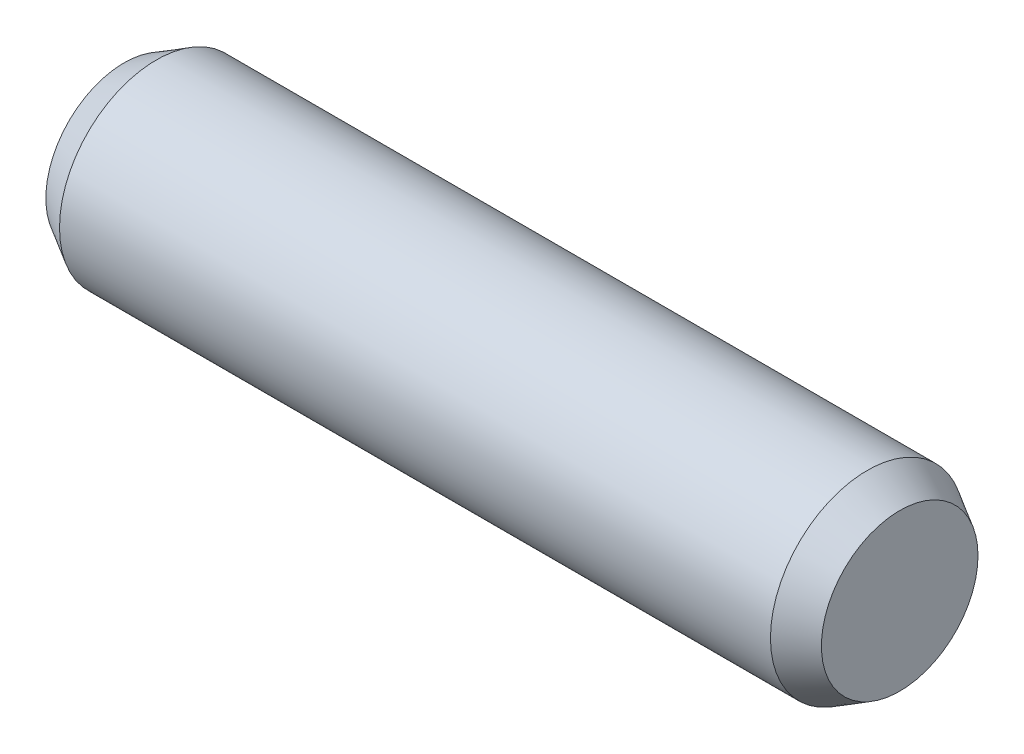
from build123d import *

# Parameters (mm, degrees)
ESQUISSE1_R        = 1.5
BOSS_EXTRU_1_DEPTH = 6
CHANFREIN2_SIZE    = 0.5
CHANFREIN2_SIZE2   = 0.288675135


with BuildPart() as part:
    # Esquisse1 → Boss.-Extru.1 (new, symmetric)
    with BuildSketch(Plane(origin=(0, 0, 0), x_dir=(0, 0, -1), z_dir=(1, 0, 0))):
        Circle(ESQUISSE1_R)
    extrude(amount=BOSS_EXTRU_1_DEPTH, both=True)

    # Chanfrein2
    chanfrein2_edges = [part.edges().sort_by_distance(p)[0] for p in [
        (-6, 0, 1.5),
        (6, 0, 1.5),
    ]]
    chanfrein2_side = [part.faces().sort_by_distance(p)[0] for p in [
        (0, 0, 1.5),
    ]]
    chamfer(chanfrein2_edges, length=CHANFREIN2_SIZE, length2=CHANFREIN2_SIZE2, reference=chanfrein2_side[0])


solid = part.part
